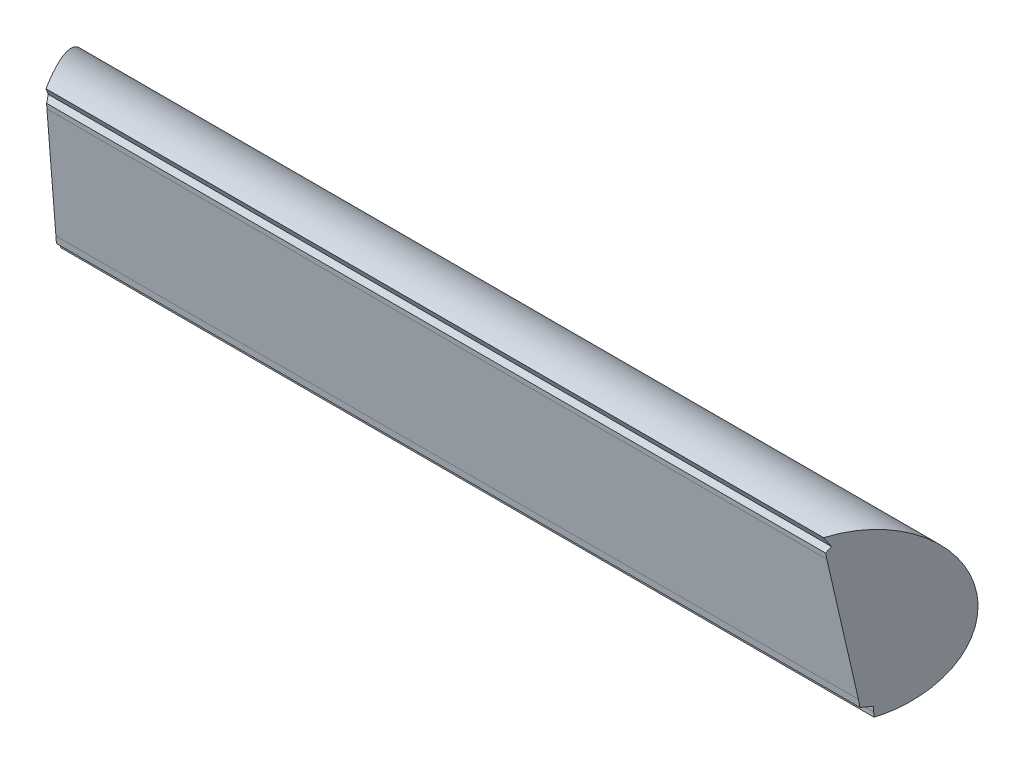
ISO-10303-21;
HEADER;
FILE_DESCRIPTION(('STEP AP214'),'2;1');
FILE_NAME('part.step','',(''),(''),'','','');
FILE_SCHEMA(('AUTOMOTIVE_DESIGN { 1 0 10303 214 1 1 1 1 }'));
ENDSEC;
DATA;
#1=APPLICATION_CONTEXT('core data for automotive mechanical design processes');
#2=APPLICATION_PROTOCOL_DEFINITION('international standard','automotive_design',2000,#1);
#3=PRODUCT_CONTEXT('',#1,'mechanical');
#4=PRODUCT('Part','Part','',(#3));
#5=PRODUCT_RELATED_PRODUCT_CATEGORY('part','',(#4));
#6=PRODUCT_DEFINITION_FORMATION('','',#4);
#7=PRODUCT_DEFINITION_CONTEXT('part definition',#1,'design');
#8=PRODUCT_DEFINITION('design','',#6,#7);
#9=PRODUCT_DEFINITION_SHAPE('','',#8);
#10=(LENGTH_UNIT() NAMED_UNIT(*) SI_UNIT(.MILLI.,.METRE.));
#11=(NAMED_UNIT(*) PLANE_ANGLE_UNIT() SI_UNIT($,.RADIAN.));
#12=(NAMED_UNIT(*) SI_UNIT($,.STERADIAN.) SOLID_ANGLE_UNIT());
#13=UNCERTAINTY_MEASURE_WITH_UNIT(LENGTH_MEASURE(1.E-05),#10,'distance_accuracy_value','');
#14=(GEOMETRIC_REPRESENTATION_CONTEXT(3) GLOBAL_UNCERTAINTY_ASSIGNED_CONTEXT((#13)) GLOBAL_UNIT_ASSIGNED_CONTEXT((#10,
#11,#12)) REPRESENTATION_CONTEXT('',''));
#15=CARTESIAN_POINT('',(0.,0.,0.));
#16=DIRECTION('',(0.,0.,1.));
#17=DIRECTION('',(1.,0.,0.));
#18=AXIS2_PLACEMENT_3D('',#15,#16,#17);
#19=CARTESIAN_POINT('',(130.766471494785,190.083479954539,30.2641897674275));
#20=DIRECTION('',(0.,0.0558790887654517,-0.998437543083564));
#21=DIRECTION('',(-1.,0.,0.));
#22=AXIS2_PLACEMENT_3D('',#19,#20,#21);
#23=PLANE('',#22);
#24=CARTESIAN_POINT('',(68.5745638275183,191.093536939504,30.3212532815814));
#25=DIRECTION('',(0.999999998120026,-6.12207850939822E-05,-3.45869457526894E-06));
#26=VECTOR('',#25,1.);
#27=LINE('',#24,#26);
#28=CARTESIAN_POINT('',(68.5745638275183,191.093539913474,30.321200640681));
#29=VERTEX_POINT('',#28);
#30=CARTESIAN_POINT('',(85.4669796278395,191.092470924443,30.3217585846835));
#31=VERTEX_POINT('',#30);
#32=EDGE_CURVE('E260',#29,#31,#27,.T.);
#33=ORIENTED_EDGE('',*,*,#32,.F.);
#34=CARTESIAN_POINT('',(68.5745638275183,191.093566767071,30.3207208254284));
#35=DIRECTION('',(-0.0881626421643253,-0.994549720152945,-0.0556615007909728));
#36=VECTOR('',#35,1.);
#37=LINE('',#34,#36);
#38=CARTESIAN_POINT('',(68.48502388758,190.083479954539,30.2641897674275));
#39=VERTEX_POINT('',#38);
#40=EDGE_CURVE('E253',#29,#39,#37,.T.);
#41=ORIENTED_EDGE('',*,*,#40,.T.);
#42=DIRECTION('',(-1.,0.,0.));
#43=VECTOR('',#42,1.);
#44=CARTESIAN_POINT('',(130.766471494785,190.083479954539,30.2641897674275));
#45=LINE('',#44,#43);
#46=CARTESIAN_POINT('',(85.5009569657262,190.083479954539,30.2641897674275));
#47=VERTEX_POINT('',#46);
#48=EDGE_CURVE('E29',#47,#39,#45,.T.);
#49=ORIENTED_EDGE('',*,*,#48,.F.);
#50=DIRECTION('',(-0.0310820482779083,0.99795513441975,0.0558520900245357));
#51=VECTOR('',#50,1.);
#52=CARTESIAN_POINT('',(85.5446876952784,188.679412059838,30.1856089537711));
#53=LINE('',#52,#51);
#54=EDGE_CURVE('E294',#47,#31,#53,.T.);
#55=ORIENTED_EDGE('',*,*,#54,.T.);
#56=EDGE_LOOP('',(#33,#41,#49,#55));
#57=FACE_BOUND('',#56,.T.);
#58=ADVANCED_FACE('F16',(#57),#23,.F.);
#59=CARTESIAN_POINT('',(130.766471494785,190.083479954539,30.2641897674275));
#60=DIRECTION('',(0.,0.0558790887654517,-0.998437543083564));
#61=DIRECTION('',(-1.,0.,0.));
#62=AXIS2_PLACEMENT_3D('',#59,#60,#61);
#63=PLANE('',#62);
#64=CARTESIAN_POINT('',(-85.4669795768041,191.092502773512,30.3211948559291));
#65=DIRECTION('',(0.999999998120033,6.12206729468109E-05,3.45868823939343E-06));
#66=VECTOR('',#65,1.);
#67=LINE('',#64,#66);
#68=CARTESIAN_POINT('',(-85.4669795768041,191.092470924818,30.3217585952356));
#69=VERTEX_POINT('',#68);
#70=CARTESIAN_POINT('',(-68.5745604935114,191.093539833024,30.321202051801));
#71=VERTEX_POINT('',#70);
#72=EDGE_CURVE('E158',#69,#71,#67,.T.);
#73=ORIENTED_EDGE('',*,*,#72,.F.);
#74=DIRECTION('',(-0.0310820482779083,-0.99795513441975,-0.0558520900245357));
#75=VECTOR('',#74,1.);
#76=CARTESIAN_POINT('',(-85.5446876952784,188.679412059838,30.1856089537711));
#77=LINE('',#76,#75);
#78=CARTESIAN_POINT('',(-85.5009569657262,190.083479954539,30.2641897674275));
#79=VERTEX_POINT('',#78);
#80=EDGE_CURVE('E280',#69,#79,#77,.T.);
#81=ORIENTED_EDGE('',*,*,#80,.T.);
#82=DIRECTION('',(-1.,0.,0.));
#83=VECTOR('',#82,1.);
#84=CARTESIAN_POINT('',(130.766471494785,190.083479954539,30.2641897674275));
#85=LINE('',#84,#83);
#86=CARTESIAN_POINT('',(-68.48501777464,190.083479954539,30.2641897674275));
#87=VERTEX_POINT('',#86);
#88=EDGE_CURVE('E10',#87,#79,#85,.T.);
#89=ORIENTED_EDGE('',*,*,#88,.F.);
#90=CARTESIAN_POINT('',(-68.4850177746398,190.083479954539,30.2641897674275));
#91=DIRECTION('',(-0.0881653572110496,0.994549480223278,0.0556614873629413));
#92=VECTOR('',#91,1.);
#93=LINE('',#90,#92);
#94=EDGE_CURVE('E153',#87,#71,#93,.T.);
#95=ORIENTED_EDGE('',*,*,#94,.T.);
#96=EDGE_LOOP('',(#73,#81,#89,#95));
#97=FACE_BOUND('',#96,.T.);
#98=ADVANCED_FACE('F156',(#97),#63,.F.);
#99=CARTESIAN_POINT('',(130.766471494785,192.291263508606,32.1584485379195));
#100=DIRECTION('',(0.,0.994627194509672,-0.103521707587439));
#101=DIRECTION('',(-1.,0.,0.));
#102=AXIS2_PLACEMENT_3D('',#99,#100,#101);
#103=PLANE('',#102);
#104=DIRECTION('',(-1.,0.,0.));
#105=VECTOR('',#104,1.);
#106=CARTESIAN_POINT('',(130.766471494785,192.105999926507,30.378452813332));
#107=LINE('',#106,#105);
#108=CARTESIAN_POINT('',(85.44254800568,192.1059692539,30.37630526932));
#109=VERTEX_POINT('',#108);
#110=CARTESIAN_POINT('',(-85.44254800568,192.1059692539,30.37630526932));
#111=VERTEX_POINT('',#110);
#112=EDGE_CURVE('E283',#109,#111,#107,.T.);
#113=ORIENTED_EDGE('',*,*,#112,.F.);
#114=DIRECTION('',(-0.484279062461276,0.0905725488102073,0.870212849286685));
#115=VECTOR('',#114,1.);
#116=CARTESIAN_POINT('',(85.4379675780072,192.105887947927,30.3773769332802));
#117=LINE('',#116,#115);
#118=CARTESIAN_POINT('',(84.4467897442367,192.291263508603,32.1584485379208));
#119=VERTEX_POINT('',#118);
#120=EDGE_CURVE('E114',#109,#119,#117,.T.);
#121=ORIENTED_EDGE('',*,*,#120,.T.);
#122=DIRECTION('',(1.,0.,0.));
#123=VECTOR('',#122,1.);
#124=CARTESIAN_POINT('',(-84.44678974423,192.2912635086,32.15844853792));
#125=LINE('',#124,#123);
#126=CARTESIAN_POINT('',(-84.4467897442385,192.291263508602,32.1584485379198));
#127=VERTEX_POINT('',#126);
#128=EDGE_CURVE('E324',#127,#119,#125,.T.);
#129=ORIENTED_EDGE('',*,*,#128,.F.);
#130=DIRECTION('',(-0.484279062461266,-0.0905725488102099,-0.87021284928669));
#131=VECTOR('',#130,1.);
#132=CARTESIAN_POINT('',(-84.4467897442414,192.291263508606,32.1584485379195));
#133=LINE('',#132,#131);
#134=EDGE_CURVE('E125',#127,#111,#133,.T.);
#135=ORIENTED_EDGE('',*,*,#134,.T.);
#136=EDGE_LOOP('',(#113,#121,#129,#135));
#137=FACE_BOUND('',#136,.T.);
#138=ADVANCED_FACE('F606',(#137),#103,.F.);
#139=CARTESIAN_POINT('',(130.766471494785,193.8098815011,32.37458143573));
#140=DIRECTION('',(0.,0.159331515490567,-0.987225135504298));
#141=DIRECTION('',(-1.,0.,0.));
#142=AXIS2_PLACEMENT_3D('',#139,#140,#141);
#143=PLANE('',#142);
#144=DIRECTION('',(-1.,0.,0.));
#145=VECTOR('',#144,1.);
#146=CARTESIAN_POINT('',(84.32651039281,193.8098815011,32.37458143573));
#147=LINE('',#146,#145);
#148=CARTESIAN_POINT('',(84.3265103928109,193.8098815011,32.37458143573));
#149=VERTEX_POINT('',#148);
#150=CARTESIAN_POINT('',(-84.3265103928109,193.8098815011,32.37458143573));
#151=VERTEX_POINT('',#150);
#152=EDGE_CURVE('E321',#149,#151,#147,.T.);
#153=ORIENTED_EDGE('',*,*,#152,.F.);
#154=DIRECTION('',(-0.0883224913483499,0.983366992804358,0.158708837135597));
#155=VECTOR('',#154,1.);
#156=CARTESIAN_POINT('',(84.6887821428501,189.776411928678,31.7236064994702));
#157=LINE('',#156,#155);
#158=CARTESIAN_POINT('',(81.9480153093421,220.29162496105,36.6485572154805));
#159=VERTEX_POINT('',#158);
#160=EDGE_CURVE('E319',#149,#159,#157,.T.);
#161=ORIENTED_EDGE('',*,*,#160,.T.);
#162=DIRECTION('',(-1.,0.,0.));
#163=VECTOR('',#162,1.);
#164=CARTESIAN_POINT('',(130.766471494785,220.29162496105,36.6485572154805));
#165=LINE('',#164,#163);
#166=CARTESIAN_POINT('',(-81.9480153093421,220.29162496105,36.6485572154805));
#167=VERTEX_POINT('',#166);
#168=EDGE_CURVE('E329',#159,#167,#165,.T.);
#169=ORIENTED_EDGE('',*,*,#168,.T.);
#170=DIRECTION('',(-0.0883224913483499,-0.983366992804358,-0.158708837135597));
#171=VECTOR('',#170,1.);
#172=CARTESIAN_POINT('',(-84.6887821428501,189.776411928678,31.7236064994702));
#173=LINE('',#172,#171);
#174=EDGE_CURVE('E341',#167,#151,#173,.T.);
#175=ORIENTED_EDGE('',*,*,#174,.T.);
#176=EDGE_LOOP('',(#153,#161,#169,#175));
#177=FACE_BOUND('',#176,.T.);
#178=ADVANCED_FACE('F554',(#177),#143,.F.);
#179=CARTESIAN_POINT('',(0.,207.1859891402,33.67364163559));
#180=DIRECTION('',(-1.,0.,0.));
#181=DIRECTION('',(0.,0.,-1.));
#182=AXIS2_PLACEMENT_3D('',#179,#180,#181);
#183=CYLINDRICAL_SURFACE('',#182,17.43904062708);
#184=DIRECTION('',(-1.,0.,0.));
#185=VECTOR('',#184,1.);
#186=CARTESIAN_POINT('',(0.,207.1859891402,16.23460100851));
#187=LINE('',#186,#185);
#188=CARTESIAN_POINT('',(93.3085130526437,207.1859891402,16.2346019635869));
#189=VERTEX_POINT('',#188);
#190=CARTESIAN_POINT('',(-93.3085130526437,207.1859891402,16.2346019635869));
#191=VERTEX_POINT('',#190);
#192=EDGE_CURVE('E271',#189,#191,#187,.T.);
#193=ORIENTED_EDGE('',*,*,#192,.F.);
#194=CARTESIAN_POINT('',(93.3085130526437,207.1859891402,16.2346019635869));
#195=CARTESIAN_POINT('',(93.3085130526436,198.498568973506,16.2346019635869));
#196=CARTESIAN_POINT('',(90.2422655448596,191.781932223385,21.7444168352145));
#197=CARTESIAN_POINT('',(85.5009569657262,190.083479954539,30.2641897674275));
#198=(BOUNDED_CURVE() B_SPLINE_CURVE(3,(#194,#195,#196,#197),.UNSPECIFIED.,.F.,
.F.) B_SPLINE_CURVE_WITH_KNOTS((4,4),(3.1415926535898,4.51561474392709),
.UNSPECIFIED.) CURVE() GEOMETRIC_REPRESENTATION_ITEM() RATIONAL_B_SPLINE_CURVE((1.,
0.84876343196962,0.84876343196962,1.)) REPRESENTATION_ITEM(''));
#199=EDGE_CURVE('E297',#189,#47,#198,.T.);
#200=ORIENTED_EDGE('',*,*,#199,.T.);
#201=ORIENTED_EDGE('',*,*,#48,.T.);
#202=CARTESIAN_POINT('',(-68.48501777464,190.083479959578,30.2641896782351));
#203=DIRECTION('',(1.,0.,0.));
#204=VECTOR('',#203,1.);
#205=LINE('',#202,#204);
#206=EDGE_CURVE('E238',#87,#39,#205,.T.);
#207=ORIENTED_EDGE('',*,*,#206,.F.);
#208=ORIENTED_EDGE('',*,*,#88,.T.);
#209=CARTESIAN_POINT('',(-85.5009569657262,190.083479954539,30.2641897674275));
#210=CARTESIAN_POINT('',(-90.2422655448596,191.781932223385,21.7444168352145));
#211=CARTESIAN_POINT('',(-93.3085130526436,198.498568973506,16.2346019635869));
#212=CARTESIAN_POINT('',(-93.3085130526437,207.1859891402,16.2346019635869));
#213=(BOUNDED_CURVE() B_SPLINE_CURVE(3,(#209,#210,#211,#212),.UNSPECIFIED.,.F.,
.F.) B_SPLINE_CURVE_WITH_KNOTS((4,4),(1.7675705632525,3.1415926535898),
.UNSPECIFIED.) CURVE() GEOMETRIC_REPRESENTATION_ITEM() RATIONAL_B_SPLINE_CURVE((1.,
0.84876343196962,0.84876343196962,1.)) REPRESENTATION_ITEM(''));
#214=EDGE_CURVE('E291',#79,#191,#213,.T.);
#215=ORIENTED_EDGE('',*,*,#214,.T.);
#216=EDGE_LOOP('',(#193,#200,#201,#207,#208,#215));
#217=FACE_BOUND('',#216,.T.);
#218=ADVANCED_FACE('F248',(#217),#183,.T.);
#219=CARTESIAN_POINT('',(0.,224.2884970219,37.08309351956));
#220=DIRECTION('',(0.,0.500123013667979,-0.865954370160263));
#221=DIRECTION('',(-1.,0.,0.));
#222=AXIS2_PLACEMENT_3D('',#219,#220,#221);
#223=PLANE('',#222);
#224=DIRECTION('',(-0.268130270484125,-0.834245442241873,-0.481809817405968));
#225=VECTOR('',#224,1.);
#226=CARTESIAN_POINT('',(-85.7885486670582,211.58688550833,29.7474092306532));
#227=LINE('',#226,#225);
#228=CARTESIAN_POINT('',(-81.7061940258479,224.288494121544,37.0830917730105));
#229=VERTEX_POINT('',#228);
#230=CARTESIAN_POINT('',(-82.0011186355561,223.370882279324,36.5531345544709));
#231=VERTEX_POINT('',#230);
#232=EDGE_CURVE('E326',#229,#231,#227,.T.);
#233=ORIENTED_EDGE('',*,*,#232,.T.);
#234=DIRECTION('',(0.268132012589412,0.834244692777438,0.481810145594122));
#235=VECTOR('',#234,1.);
#236=CARTESIAN_POINT('',(-82.30442602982,222.4271887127,36.00811410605));
#237=LINE('',#236,#235);
#238=CARTESIAN_POINT('',(-82.30442602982,222.4271887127,36.00811410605));
#239=VERTEX_POINT('',#238);
#240=EDGE_CURVE('E275',#239,#231,#237,.T.);
#241=ORIENTED_EDGE('',*,*,#240,.F.);
#242=DIRECTION('',(-1.,0.,0.));
#243=VECTOR('',#242,1.);
#244=CARTESIAN_POINT('',(82.30442602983,222.4271887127,36.00811410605));
#245=LINE('',#244,#243);
#246=CARTESIAN_POINT('',(82.30442602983,222.4271887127,36.00811410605));
#247=VERTEX_POINT('',#246);
#248=EDGE_CURVE('E235',#247,#239,#245,.T.);
#249=ORIENTED_EDGE('',*,*,#248,.F.);
#250=DIRECTION('',(-0.268131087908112,0.834244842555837,0.481810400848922));
#251=VECTOR('',#250,1.);
#252=CARTESIAN_POINT('',(82.30442602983,222.4271887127,36.00811410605));
#253=LINE('',#252,#251);
#254=CARTESIAN_POINT('',(82.0011185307,223.3708790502,36.55313374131));
#255=VERTEX_POINT('',#254);
#256=EDGE_CURVE('E345',#247,#255,#253,.T.);
#257=ORIENTED_EDGE('',*,*,#256,.T.);
#258=DIRECTION('',(-0.268130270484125,0.834245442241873,0.481809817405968));
#259=VECTOR('',#258,1.);
#260=CARTESIAN_POINT('',(85.7885486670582,211.58688550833,29.7474092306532));
#261=LINE('',#260,#259);
#262=CARTESIAN_POINT('',(81.7061940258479,224.288494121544,37.0830917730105));
#263=VERTEX_POINT('',#262);
#264=EDGE_CURVE('E342',#255,#263,#261,.T.);
#265=ORIENTED_EDGE('',*,*,#264,.T.);
#266=DIRECTION('',(-1.,0.,0.));
#267=VECTOR('',#266,1.);
#268=CARTESIAN_POINT('',(76.28425322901,224.2884941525,37.08309171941));
#269=LINE('',#268,#267);
#270=EDGE_CURVE('E254',#263,#229,#269,.T.);
#271=ORIENTED_EDGE('',*,*,#270,.T.);
#272=EDGE_LOOP('',(#233,#241,#249,#257,#265,#271));
#273=FACE_BOUND('',#272,.T.);
#274=ADVANCED_FACE('F18',(#273),#223,.F.);
#275=CARTESIAN_POINT('',(0.,221.4201721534,36.80917441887));
#276=DIRECTION('',(0.,0.62253518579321,0.782591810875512));
#277=DIRECTION('',(1.,0.,0.));
#278=AXIS2_PLACEMENT_3D('',#275,#276,#277);
#279=PLANE('',#278);
#280=DIRECTION('',(-0.327356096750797,-0.739471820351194,0.588234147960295));
#281=VECTOR('',#280,1.);
#282=CARTESIAN_POINT('',(82.30442602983,222.4271887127,36.00811410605));
#283=LINE('',#282,#281);
#284=CARTESIAN_POINT('',(81.85863079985,221.4201721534,36.80917441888));
#285=VERTEX_POINT('',#284);
#286=EDGE_CURVE('E320',#247,#285,#283,.T.);
#287=ORIENTED_EDGE('',*,*,#286,.F.);
#288=ORIENTED_EDGE('',*,*,#248,.T.);
#289=DIRECTION('',(0.327356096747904,-0.739471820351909,0.588234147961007));
#290=VECTOR('',#289,1.);
#291=CARTESIAN_POINT('',(-82.30442602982,222.4271887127,36.00811410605));
#292=LINE('',#291,#290);
#293=CARTESIAN_POINT('',(-81.85863079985,221.4201721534,36.80917441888));
#294=VERTEX_POINT('',#293);
#295=EDGE_CURVE('E325',#239,#294,#292,.T.);
#296=ORIENTED_EDGE('',*,*,#295,.T.);
#297=DIRECTION('',(1.,0.,0.));
#298=VECTOR('',#297,1.);
#299=CARTESIAN_POINT('',(-81.85863079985,221.4201721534,36.80917441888));
#300=LINE('',#299,#298);
#301=EDGE_CURVE('E44',#294,#285,#300,.T.);
#302=ORIENTED_EDGE('',*,*,#301,.T.);
#303=EDGE_LOOP('',(#287,#288,#296,#302));
#304=FACE_BOUND('',#303,.T.);
#305=ADVANCED_FACE('F399',(#304),#279,.T.);
#306=CARTESIAN_POINT('',(0.,220.6250297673,36.69600808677));
#307=DIRECTION('',(0.,-0.140902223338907,0.990023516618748));
#308=DIRECTION('',(-1.,0.,0.));
#309=AXIS2_PLACEMENT_3D('',#306,#307,#308);
#310=PLANE('',#309);
#311=DIRECTION('',(0.0781730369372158,-0.986993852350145,-0.140471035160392));
#312=VECTOR('',#311,1.);
#313=CARTESIAN_POINT('',(81.85863079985,221.4201721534,36.80917441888));
#314=LINE('',#313,#312);
#315=EDGE_CURVE('E315',#285,#159,#314,.T.);
#316=ORIENTED_EDGE('',*,*,#315,.F.);
#317=ORIENTED_EDGE('',*,*,#301,.F.);
#318=DIRECTION('',(-0.0781730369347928,-0.986993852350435,-0.140471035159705));
#319=VECTOR('',#318,1.);
#320=CARTESIAN_POINT('',(-81.85863079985,221.4201721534,36.80917441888));
#321=LINE('',#320,#319);
#322=EDGE_CURVE('E334',#294,#167,#321,.T.);
#323=ORIENTED_EDGE('',*,*,#322,.T.);
#324=ORIENTED_EDGE('',*,*,#168,.F.);
#325=EDGE_LOOP('',(#316,#317,#323,#324));
#326=FACE_BOUND('',#325,.T.);
#327=ADVANCED_FACE('F534',(#326),#310,.T.);
#328=CARTESIAN_POINT('',(0.,192.2912635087,32.15844853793));
#329=DIRECTION('',(0.,-0.140902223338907,0.990023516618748));
#330=DIRECTION('',(-1.,0.,0.));
#331=AXIS2_PLACEMENT_3D('',#328,#329,#330);
#332=PLANE('',#331);
#333=DIRECTION('',(0.0781730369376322,-0.986993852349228,-0.140471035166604));
#334=VECTOR('',#333,1.);
#335=CARTESIAN_POINT('',(84.32651039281,193.8098815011,32.37458143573));
#336=LINE('',#335,#334);
#337=EDGE_CURVE('E166',#149,#119,#336,.T.);
#338=ORIENTED_EDGE('',*,*,#337,.F.);
#339=ORIENTED_EDGE('',*,*,#152,.T.);
#340=DIRECTION('',(-0.078173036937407,-0.986993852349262,-0.140471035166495));
#341=VECTOR('',#340,1.);
#342=CARTESIAN_POINT('',(-84.32651039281,193.8098815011,32.37458143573));
#343=LINE('',#342,#341);
#344=EDGE_CURVE('E279',#151,#127,#343,.T.);
#345=ORIENTED_EDGE('',*,*,#344,.T.);
#346=ORIENTED_EDGE('',*,*,#128,.T.);
#347=EDGE_LOOP('',(#338,#339,#345,#346));
#348=FACE_BOUND('',#347,.T.);
#349=ADVANCED_FACE('F544',(#348),#332,.T.);
#350=CARTESIAN_POINT('',(-103.4256405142,-63.96212064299,-1.945110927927));
#351=DIRECTION('',(-0.873804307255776,0.,0.486277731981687));
#352=DIRECTION('',(0.,1.,0.));
#353=AXIS2_PLACEMENT_3D('',#350,#351,#352);
#354=PLANE('',#353);
#355=ORIENTED_EDGE('',*,*,#240,.T.);
#356=ORIENTED_EDGE('',*,*,#232,.F.);
#357=CARTESIAN_POINT('',(-93.3085130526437,207.1859891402,16.2346019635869));
#358=CARTESIAN_POINT('',(-93.3085130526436,219.073277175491,16.2346019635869));
#359=CARTESIAN_POINT('',(-88.1938855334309,226.612541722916,25.4252007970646));
#360=CARTESIAN_POINT('',(-81.7061940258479,224.288494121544,37.0830917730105));
#361=(BOUNDED_CURVE() B_SPLINE_CURVE(3,(#357,#358,#359,#360),.UNSPECIFIED.,.F.,
.F.) B_SPLINE_CURVE_WITH_KNOTS((4,4),(3.1415926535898,4.9091631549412),
.UNSPECIFIED.) CURVE() GEOMETRIC_REPRESENTATION_ITEM() RATIONAL_B_SPLINE_CURVE((1.,
0.756152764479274,0.756152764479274,1.)) REPRESENTATION_ITEM(''));
#362=EDGE_CURVE('E262',#191,#229,#361,.T.);
#363=ORIENTED_EDGE('',*,*,#362,.F.);
#364=ORIENTED_EDGE('',*,*,#214,.F.);
#365=ORIENTED_EDGE('',*,*,#80,.F.);
#366=CARTESIAN_POINT('',(-85.44254800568,192.105848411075,30.3784442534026));
#367=DIRECTION('',(-0.0240644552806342,-0.998118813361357,-0.0563891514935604));
#368=VECTOR('',#367,1.);
#369=LINE('',#366,#368);
#370=EDGE_CURVE('E172',#111,#69,#369,.T.);
#371=ORIENTED_EDGE('',*,*,#370,.F.);
#372=ORIENTED_EDGE('',*,*,#134,.F.);
#373=ORIENTED_EDGE('',*,*,#344,.F.);
#374=ORIENTED_EDGE('',*,*,#174,.F.);
#375=ORIENTED_EDGE('',*,*,#322,.F.);
#376=ORIENTED_EDGE('',*,*,#295,.F.);
#377=EDGE_LOOP('',(#355,#356,#363,#364,#365,#371,#372,#373,#374,#375,#376));
#378=FACE_BOUND('',#377,.T.);
#379=ADVANCED_FACE('F404',(#378),#354,.T.);
#380=CARTESIAN_POINT('',(103.4256405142,-63.96212064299,-1.945110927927));
#381=DIRECTION('',(-0.873804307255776,0.,-0.486277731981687));
#382=DIRECTION('',(-0.486277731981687,0.,0.873804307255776));
#383=AXIS2_PLACEMENT_3D('',#380,#381,#382);
#384=PLANE('',#383);
#385=ORIENTED_EDGE('',*,*,#337,.T.);
#386=ORIENTED_EDGE('',*,*,#120,.F.);
#387=CARTESIAN_POINT('',(85.4669796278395,191.092502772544,30.3211948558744));
#388=DIRECTION('',(-0.0240645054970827,0.998118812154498,0.0563891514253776));
#389=VECTOR('',#388,1.);
#390=LINE('',#387,#389);
#391=EDGE_CURVE('E286',#31,#109,#390,.T.);
#392=ORIENTED_EDGE('',*,*,#391,.F.);
#393=ORIENTED_EDGE('',*,*,#54,.F.);
#394=ORIENTED_EDGE('',*,*,#199,.F.);
#395=CARTESIAN_POINT('',(81.7061940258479,224.288494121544,37.0830917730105));
#396=CARTESIAN_POINT('',(88.1938855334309,226.612541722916,25.4252007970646));
#397=CARTESIAN_POINT('',(93.3085130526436,219.073277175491,16.2346019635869));
#398=CARTESIAN_POINT('',(93.3085130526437,207.1859891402,16.2346019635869));
#399=(BOUNDED_CURVE() B_SPLINE_CURVE(3,(#395,#396,#397,#398),.UNSPECIFIED.,.F.,
.F.) B_SPLINE_CURVE_WITH_KNOTS((4,4),(1.37402215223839,3.1415926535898),
.UNSPECIFIED.) CURVE() GEOMETRIC_REPRESENTATION_ITEM() RATIONAL_B_SPLINE_CURVE((1.,
0.756152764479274,0.756152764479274,1.)) REPRESENTATION_ITEM(''));
#400=EDGE_CURVE('E377',#263,#189,#399,.T.);
#401=ORIENTED_EDGE('',*,*,#400,.F.);
#402=ORIENTED_EDGE('',*,*,#264,.F.);
#403=ORIENTED_EDGE('',*,*,#256,.F.);
#404=ORIENTED_EDGE('',*,*,#286,.T.);
#405=ORIENTED_EDGE('',*,*,#315,.T.);
#406=ORIENTED_EDGE('',*,*,#160,.F.);
#407=EDGE_LOOP('',(#385,#386,#392,#393,#394,#401,#402,#403,#404,#405,#406));
#408=FACE_BOUND('',#407,.T.);
#409=ADVANCED_FACE('F192',(#408),#384,.F.);
#410=CARTESIAN_POINT('',(0.,194.1288212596,30.49273297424));
#411=DIRECTION('',(0.,0.0564054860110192,-0.998407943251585));
#412=DIRECTION('',(-1.,0.,0.));
#413=AXIS2_PLACEMENT_3D('',#410,#411,#412);
#414=PLANE('',#413);
#415=ORIENTED_EDGE('',*,*,#206,.T.);
#416=ORIENTED_EDGE('',*,*,#40,.F.);
#417=ORIENTED_EDGE('',*,*,#32,.T.);
#418=ORIENTED_EDGE('',*,*,#391,.T.);
#419=ORIENTED_EDGE('',*,*,#112,.T.);
#420=ORIENTED_EDGE('',*,*,#370,.T.);
#421=ORIENTED_EDGE('',*,*,#72,.T.);
#422=ORIENTED_EDGE('',*,*,#94,.F.);
#423=EDGE_LOOP('',(#415,#416,#417,#418,#419,#420,#421,#422));
#424=FACE_BOUND('',#423,.T.);
#425=ADVANCED_FACE('F170',(#424),#414,.F.);
#426=CARTESIAN_POINT('',(0.,207.1859891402,33.67364163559));
#427=DIRECTION('',(-1.,0.,0.));
#428=DIRECTION('',(0.,0.,-1.));
#429=AXIS2_PLACEMENT_3D('',#426,#427,#428);
#430=CYLINDRICAL_SURFACE('',#429,17.43904062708);
#431=ORIENTED_EDGE('',*,*,#400,.T.);
#432=ORIENTED_EDGE('',*,*,#192,.T.);
#433=ORIENTED_EDGE('',*,*,#362,.T.);
#434=ORIENTED_EDGE('',*,*,#270,.F.);
#435=EDGE_LOOP('',(#431,#432,#433,#434));
#436=FACE_BOUND('',#435,.T.);
#437=ADVANCED_FACE('F191',(#436),#430,.T.);
#438=CLOSED_SHELL('',(#58,#98,#138,#178,#218,#274,#305,#327,#349,#379,#409,#425,#437));
#439=MANIFOLD_SOLID_BREP('B1',#438);
#440=ADVANCED_BREP_SHAPE_REPRESENTATION('',(#18,#439),#14);
#441=SHAPE_DEFINITION_REPRESENTATION(#9,#440);
ENDSEC;
END-ISO-10303-21;
